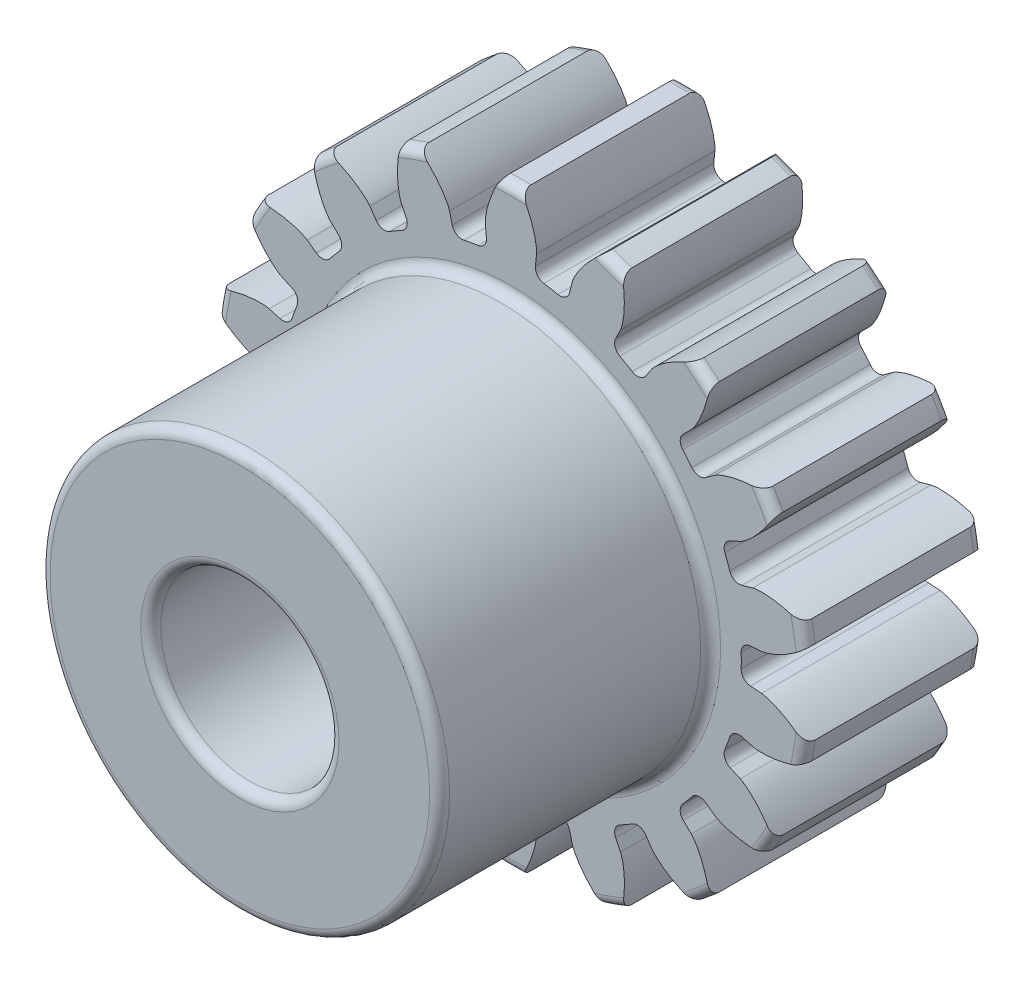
from build123d import *

# Parameters (mm, degrees)
BOSS_EXTRUDE1_DEPTH      = 4.0005
BOSS_EXTRUDE1_DEPTH_BACK = 4.0005
SKETCH3_R                = 5.291666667
SKETCH5_W                = 4.826
SKETCH5_H                = 1.735666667
SKETCH5_W_2              = 8.001
SKETCH5_H_2              = 1.5875
FILLET2_R                = 0.177538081
CUT_EXTRUDE1_DEPTH       = 9.485721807
FILLET1_R                = 0.177538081
CIRPATTERN1_COUNT        = 18
FILLET1_OF_CIRPATTERN1_R = 0.177538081


with BuildPart() as part:
    # Sketch3 → Boss-Extrude1 (new, two sides: drawn at the far end of the back side and taken through both)
    with BuildSketch(Plane.XY.offset(-BOSS_EXTRUDE1_DEPTH_BACK)):
        Circle(SKETCH3_R)
    extrude(amount=BOSS_EXTRUDE1_DEPTH + BOSS_EXTRUDE1_DEPTH_BACK)

    # Sketch5 → Cut-Revolve1 (revolve, cut)
    with BuildSketch(Plane(origin=(0, 0, 0), x_dir=(0, 0, -1), z_dir=(1, 0, 0)), mode=Mode.PRIVATE) as cut_revolve1_sk:
        with Locations((-1.5875, 4.423833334)):
            Rectangle(SKETCH5_W, SKETCH5_H)
        with Locations((0, 0.79375)):
            Rectangle(SKETCH5_W_2, SKETCH5_H_2)
    revolve(cut_revolve1_sk.sketch.rotate(Axis((0, 0, 4.0005), (0, 0, -1)), 90), axis=Axis((0, 0, 4.0005), (0, 0, -1)), mode=Mode.SUBTRACT)

    # Fillet2
    fillet2_edges = [part.edges().sort_by_distance(p)[0] for p in [
        (-1.5875, 0, 4.0005),
        (-1.5875, 0, -4.0005),
        (-3.556, 0, 4.0005),
        (-3.556, 0, -0.8255),
        (-5.291666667, 0, -0.8255),
        (-5.291666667, 0, -4.0005),
    ]]
    fillet(fillet2_edges, radius=FILLET2_R)

    # Sketch4 → Cut-Extrude1 (cut, symmetric)
    with BuildSketch(Plane.XY):
        with BuildLine():
            Line((4.090309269, 0.296500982), (4.463574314, 0.32355846))
            add(Edge.make_bspline(
                [(4.463574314, 0.32355846), (4.464886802, 0.32367123), (4.468563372, 0.324041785), (4.475494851, 0.324956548), (4.48677203, 0.326752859), (4.501087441, 0.329487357), (4.519520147, 0.333532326), (4.54113554, 0.338952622), (4.564776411, 0.345593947), (4.590362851, 0.353555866), (4.615762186, 0.362148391), (4.640973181, 0.371322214), (4.66596833, 0.38100282), (4.696096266, 0.393367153), (4.732009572, 0.409078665), (4.773653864, 0.42872569), (4.820474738, 0.452516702), (4.867724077, 0.478364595), (4.913821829, 0.50511076), (4.959913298, 0.533629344), (5.004164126, 0.562281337), (5.049596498, 0.593556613), (5.091265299, 0.623197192), (5.137329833, 0.658064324), (5.174326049, 0.686688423), (5.212005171, 0.717628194), (5.230263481, 0.732888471), (5.239560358, 0.740772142)],
                knots=[0, 0, 0, 0, 0, 0.005376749, 0.015083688, 0.02853182, 0.04661014, 0.064854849, 0.092110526, 0.119476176, 0.146842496, 0.174208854, 0.201574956, 0.228941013, 0.256307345, 0.307035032, 0.361767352, 0.416499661, 0.471231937, 0.525964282, 0.580696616, 0.635428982, 0.690161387, 0.744893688, 0.799626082, 0.854358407, 0.909090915, 0.909090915, 0.909090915, 0.909090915, 0.909090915], degree=4))
            ThreePointArc((5.239560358, 0.740772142), (5.291666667, 0), (5.239560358, -0.740772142))
            add(Edge.make_bspline(
                [(4.463574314, -0.32355846), (4.464886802, -0.32367123), (4.468563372, -0.324041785), (4.475494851, -0.324956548), (4.48677203, -0.326752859), (4.501087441, -0.329487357), (4.519520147, -0.333532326), (4.54113554, -0.338952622), (4.564776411, -0.345593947), (4.590362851, -0.353555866), (4.615762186, -0.362148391), (4.640973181, -0.371322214), (4.66596833, -0.38100282), (4.696096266, -0.393367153), (4.732009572, -0.409078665), (4.773653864, -0.42872569), (4.820474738, -0.452516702), (4.867724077, -0.478364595), (4.913821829, -0.50511076), (4.959913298, -0.533629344), (5.004164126, -0.562281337), (5.049596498, -0.593556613), (5.091265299, -0.623197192), (5.137329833, -0.658064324), (5.174326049, -0.686688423), (5.212005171, -0.717628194), (5.230263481, -0.732888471), (5.239560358, -0.740772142)],
                knots=[0, 0, 0, 0, 0, 0.005376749, 0.015083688, 0.02853182, 0.04661014, 0.064854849, 0.092110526, 0.119476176, 0.146842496, 0.174208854, 0.201574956, 0.228941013, 0.256307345, 0.307035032, 0.361767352, 0.416499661, 0.471231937, 0.525964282, 0.580696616, 0.635428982, 0.690161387, 0.744893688, 0.799626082, 0.854358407, 0.909090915, 0.909090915, 0.909090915, 0.909090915, 0.909090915], degree=4))
            Line((4.463574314, -0.32355846), (4.090309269, -0.296500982))
            ThreePointArc((4.090309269, -0.296500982), (4.101041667, 0), (4.090309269, 0.296500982))
        make_face()
    cut_extrude1 = extrude(amount=CUT_EXTRUDE1_DEPTH, both=True, mode=Mode.SUBTRACT)

    # Fillet1
    fillet1_edges = [part.edges().sort_by_distance(p)[0] for p in [
        (4.090309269, -0.296500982, -2.413),
        (4.090309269, 0.296500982, -2.413),
    ]]
    fillet(fillet1_edges, radius=FILLET1_R)

    # CirPattern1: Cut-Extrude1 ×18 about axis
    cirpattern1_axis = Axis((0, 0, 4.0005), (0, 0, -1))
    for i in range(1, CIRPATTERN1_COUNT):
        add(cut_extrude1.rotate(cirpattern1_axis, i * 360 / CIRPATTERN1_COUNT), mode=Mode.SUBTRACT)

    # Fillet1 of CirPattern1
    fillet1_of_cirpattern1_edges = [part.edges().sort_by_distance(p)[0] for p in [
        (3.742224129, -1.677587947, -2.413),
        (3.945042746, -1.120348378, -2.413),
        (2.942771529, -2.856333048, -2.413),
        (3.323945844, -2.402067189, -2.413),
        (1.788377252, -3.690562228, -2.413),
        (2.301932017, -3.394061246, -2.413),
        (0.418278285, -4.079655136, -2.413),
        (1.002271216, -3.976681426, -2.413),
        (-1.002271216, -3.976681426, -2.413),
        (-0.418278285, -4.079655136, -2.413),
        (-2.301932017, -3.394061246, -2.413),
        (-1.788377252, -3.690562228, -2.413),
        (-3.323945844, -2.402067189, -2.413),
        (-2.942771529, -2.856333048, -2.413),
        (-3.945042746, -1.120348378, -2.413),
        (-3.742224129, -1.677587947, -2.413),
        (-4.090309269, 0.296500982, -2.413),
        (-4.090309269, -0.296500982, -2.413),
        (-3.742224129, 1.677587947, -2.413),
        (-3.945042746, 1.120348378, -2.413),
        (-2.942771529, 2.856333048, -2.413),
        (-3.323945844, 2.402067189, -2.413),
        (-1.788377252, 3.690562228, -2.413),
        (-2.301932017, 3.394061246, -2.413),
        (-0.418278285, 4.079655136, -2.413),
        (-1.002271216, 3.976681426, -2.413),
        (1.002271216, 3.976681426, -2.413),
        (0.418278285, 4.079655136, -2.413),
        (2.301932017, 3.394061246, -2.413),
        (1.788377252, 3.690562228, -2.413),
        (3.323945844, 2.402067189, -2.413),
        (2.942771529, 2.856333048, -2.413),
        (3.945042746, 1.120348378, -2.413),
        (3.742224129, 1.677587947, -2.413),
    ]]
    fillet(fillet1_of_cirpattern1_edges, radius=FILLET1_OF_CIRPATTERN1_R)


solid = part.part
